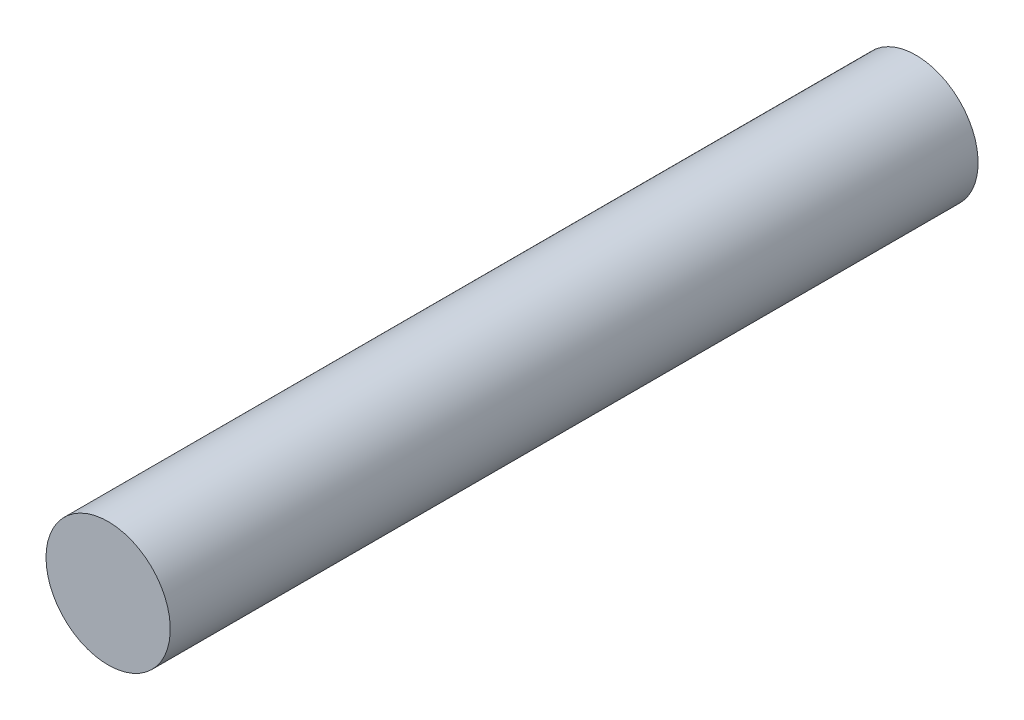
from build123d import *

# Parameters (mm, degrees)
ESQUISSE1_R      = 1
EXTRUSION1_DEPTH = 13


with BuildPart() as part:
    # Esquisse1 → Extrusion1 (new body)
    with BuildSketch(Plane.XY):
        with Locations(Location((0, 0, 0), (0, 0, 180))):
            Circle(ESQUISSE1_R)
    extrude(amount=EXTRUSION1_DEPTH)


solid = part.part
